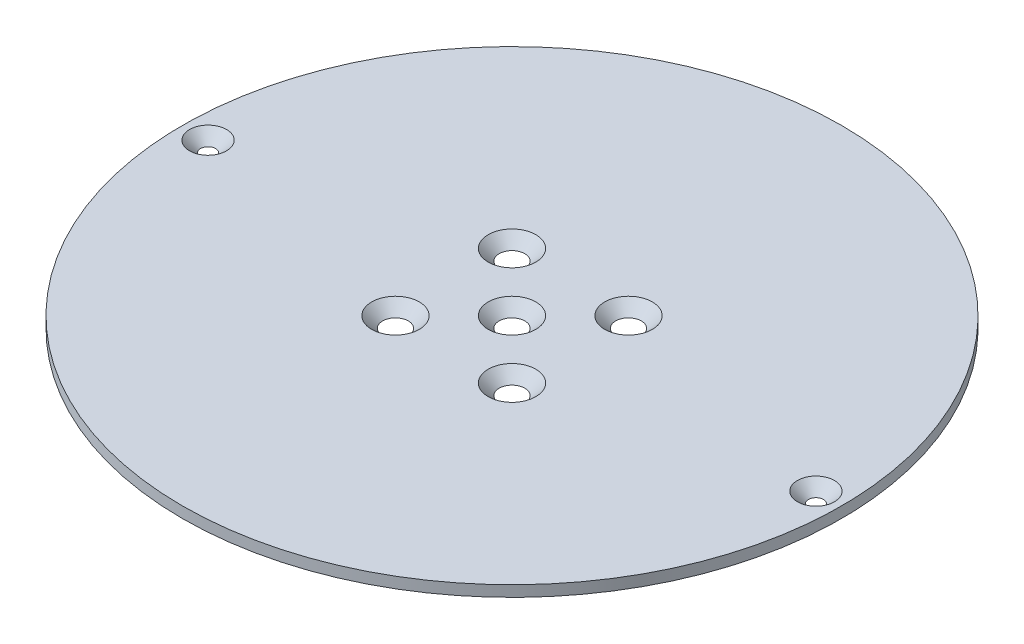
ISO-10303-21;
HEADER;
FILE_DESCRIPTION(('STEP AP214'),'2;1');
FILE_NAME('part.step','',(''),(''),'','','');
FILE_SCHEMA(('AUTOMOTIVE_DESIGN { 1 0 10303 214 1 1 1 1 }'));
ENDSEC;
DATA;
#1=APPLICATION_CONTEXT('core data for automotive mechanical design processes');
#2=APPLICATION_PROTOCOL_DEFINITION('international standard','automotive_design',2000,#1);
#3=PRODUCT_CONTEXT('',#1,'mechanical');
#4=PRODUCT('Part','Part','',(#3));
#5=PRODUCT_RELATED_PRODUCT_CATEGORY('part','',(#4));
#6=PRODUCT_DEFINITION_FORMATION('','',#4);
#7=PRODUCT_DEFINITION_CONTEXT('part definition',#1,'design');
#8=PRODUCT_DEFINITION('design','',#6,#7);
#9=PRODUCT_DEFINITION_SHAPE('','',#8);
#10=(LENGTH_UNIT() NAMED_UNIT(*) SI_UNIT(.MILLI.,.METRE.));
#11=(NAMED_UNIT(*) PLANE_ANGLE_UNIT() SI_UNIT($,.RADIAN.));
#12=(NAMED_UNIT(*) SI_UNIT($,.STERADIAN.) SOLID_ANGLE_UNIT());
#13=UNCERTAINTY_MEASURE_WITH_UNIT(LENGTH_MEASURE(1.E-05),#10,'distance_accuracy_value','');
#14=(GEOMETRIC_REPRESENTATION_CONTEXT(3) GLOBAL_UNCERTAINTY_ASSIGNED_CONTEXT((#13)) GLOBAL_UNIT_ASSIGNED_CONTEXT((#10,
#11,#12)) REPRESENTATION_CONTEXT('',''));
#15=CARTESIAN_POINT('',(0.,0.,0.));
#16=DIRECTION('',(0.,0.,1.));
#17=DIRECTION('',(1.,0.,0.));
#18=AXIS2_PLACEMENT_3D('',#15,#16,#17);
#19=CARTESIAN_POINT('',(0.,3.,0.));
#20=DIRECTION('',(0.,1.,0.));
#21=DIRECTION('',(0.,0.,1.));
#22=AXIS2_PLACEMENT_3D('',#19,#20,#21);
#23=PLANE('',#22);
#24=CARTESIAN_POINT('',(15.9099025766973,3.,15.9099025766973));
#25=DIRECTION('',(0.,1.,0.));
#26=DIRECTION('',(0.,0.,1.));
#27=AXIS2_PLACEMENT_3D('',#24,#25,#26);
#28=CIRCLE('',#27,6.49999999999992);
#29=CARTESIAN_POINT('',(15.9099025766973,3.,22.4099025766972));
#30=VERTEX_POINT('',#29);
#31=EDGE_CURVE('E10',#30,#30,#28,.F.);
#32=ORIENTED_EDGE('',*,*,#31,.T.);
#33=EDGE_LOOP('',(#32));
#34=FACE_BOUND('',#33,.T.);
#35=CARTESIAN_POINT('',(-15.9099025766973,3.,15.9099025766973));
#36=DIRECTION('',(0.,1.,0.));
#37=DIRECTION('',(0.,0.,1.));
#38=AXIS2_PLACEMENT_3D('',#35,#36,#37);
#39=CIRCLE('',#38,6.49999999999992);
#40=CARTESIAN_POINT('',(-15.9099025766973,3.,22.4099025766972));
#41=VERTEX_POINT('',#40);
#42=EDGE_CURVE('E42',#41,#41,#39,.F.);
#43=ORIENTED_EDGE('',*,*,#42,.T.);
#44=EDGE_LOOP('',(#43));
#45=FACE_BOUND('',#44,.T.);
#46=CARTESIAN_POINT('',(0.,3.,0.));
#47=DIRECTION('',(0.,1.,0.));
#48=DIRECTION('',(0.,0.,1.));
#49=AXIS2_PLACEMENT_3D('',#46,#47,#48);
#50=CIRCLE('',#49,6.49999999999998);
#51=CARTESIAN_POINT('',(0.,3.,6.49999999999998));
#52=VERTEX_POINT('',#51);
#53=EDGE_CURVE('E46',#52,#52,#50,.F.);
#54=ORIENTED_EDGE('',*,*,#53,.T.);
#55=EDGE_LOOP('',(#54));
#56=FACE_BOUND('',#55,.T.);
#57=CARTESIAN_POINT('',(15.9099025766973,3.,-15.9099025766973));
#58=DIRECTION('',(0.,1.,0.));
#59=DIRECTION('',(0.,0.,1.));
#60=AXIS2_PLACEMENT_3D('',#57,#58,#59);
#61=CIRCLE('',#60,6.49999999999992);
#62=CARTESIAN_POINT('',(15.9099025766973,3.,-9.4099025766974));
#63=VERTEX_POINT('',#62);
#64=EDGE_CURVE('E50',#63,#63,#61,.F.);
#65=ORIENTED_EDGE('',*,*,#64,.T.);
#66=EDGE_LOOP('',(#65));
#67=FACE_BOUND('',#66,.T.);
#68=CARTESIAN_POINT('',(-15.9099025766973,3.,-15.9099025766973));
#69=DIRECTION('',(0.,1.,0.));
#70=DIRECTION('',(0.,0.,1.));
#71=AXIS2_PLACEMENT_3D('',#68,#69,#70);
#72=CIRCLE('',#71,6.50000000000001);
#73=CARTESIAN_POINT('',(-15.9099025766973,3.,-9.40990257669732));
#74=VERTEX_POINT('',#73);
#75=EDGE_CURVE('E55',#74,#74,#72,.F.);
#76=ORIENTED_EDGE('',*,*,#75,.T.);
#77=EDGE_LOOP('',(#76));
#78=FACE_BOUND('',#77,.T.);
#79=CARTESIAN_POINT('',(83.,3.,0.));
#80=DIRECTION('',(0.,1.,0.));
#81=DIRECTION('',(0.,0.,1.));
#82=AXIS2_PLACEMENT_3D('',#79,#80,#81);
#83=CIRCLE('',#82,5.05000000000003);
#84=CARTESIAN_POINT('',(83.,3.,5.05000000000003));
#85=VERTEX_POINT('',#84);
#86=EDGE_CURVE('E58',#85,#85,#83,.F.);
#87=ORIENTED_EDGE('',*,*,#86,.T.);
#88=EDGE_LOOP('',(#87));
#89=FACE_BOUND('',#88,.T.);
#90=CARTESIAN_POINT('',(-83.,3.,0.));
#91=DIRECTION('',(0.,1.,0.));
#92=DIRECTION('',(0.,0.,1.));
#93=AXIS2_PLACEMENT_3D('',#90,#91,#92);
#94=CIRCLE('',#93,5.05000000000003);
#95=CARTESIAN_POINT('',(-83.,3.,5.05000000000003));
#96=VERTEX_POINT('',#95);
#97=EDGE_CURVE('E61',#96,#96,#94,.F.);
#98=ORIENTED_EDGE('',*,*,#97,.T.);
#99=EDGE_LOOP('',(#98));
#100=FACE_BOUND('',#99,.T.);
#101=CARTESIAN_POINT('',(0.,3.,0.));
#102=DIRECTION('',(0.,1.,0.));
#103=DIRECTION('',(0.,0.,1.));
#104=AXIS2_PLACEMENT_3D('',#101,#102,#103);
#105=CIRCLE('',#104,90.);
#106=CARTESIAN_POINT('',(0.,3.,90.));
#107=VERTEX_POINT('',#106);
#108=EDGE_CURVE('E64',#107,#107,#105,.T.);
#109=ORIENTED_EDGE('',*,*,#108,.T.);
#110=EDGE_LOOP('',(#109));
#111=FACE_BOUND('',#110,.T.);
#112=ADVANCED_FACE('F35',(#34,#45,#56,#67,#78,#89,#100,#111),#23,.T.);
#113=CARTESIAN_POINT('',(0.,0.,0.));
#114=DIRECTION('',(0.,1.,0.));
#115=DIRECTION('',(0.,0.,1.));
#116=AXIS2_PLACEMENT_3D('',#113,#114,#115);
#117=PLANE('',#116);
#118=CARTESIAN_POINT('',(-15.9099025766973,0.,15.9099025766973));
#119=DIRECTION('',(0.,1.,0.));
#120=DIRECTION('',(0.,0.,1.));
#121=AXIS2_PLACEMENT_3D('',#118,#119,#120);
#122=CIRCLE('',#121,3.5);
#123=CARTESIAN_POINT('',(-15.9099025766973,0.,19.4099025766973));
#124=VERTEX_POINT('',#123);
#125=EDGE_CURVE('E85',#124,#124,#122,.T.);
#126=ORIENTED_EDGE('',*,*,#125,.T.);
#127=EDGE_LOOP('',(#126));
#128=FACE_BOUND('',#127,.T.);
#129=CARTESIAN_POINT('',(15.9099025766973,0.,-15.9099025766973));
#130=DIRECTION('',(0.,1.,0.));
#131=DIRECTION('',(0.,0.,1.));
#132=AXIS2_PLACEMENT_3D('',#129,#130,#131);
#133=CIRCLE('',#132,3.5);
#134=CARTESIAN_POINT('',(15.9099025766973,0.,-12.4099025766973));
#135=VERTEX_POINT('',#134);
#136=EDGE_CURVE('E79',#135,#135,#133,.T.);
#137=ORIENTED_EDGE('',*,*,#136,.T.);
#138=EDGE_LOOP('',(#137));
#139=FACE_BOUND('',#138,.T.);
#140=CARTESIAN_POINT('',(-83.,0.,0.));
#141=DIRECTION('',(0.,1.,0.));
#142=DIRECTION('',(0.,0.,-1.));
#143=AXIS2_PLACEMENT_3D('',#140,#141,#142);
#144=CIRCLE('',#143,2.04999999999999);
#145=CARTESIAN_POINT('',(-83.,0.,-2.04999999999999));
#146=VERTEX_POINT('',#145);
#147=EDGE_CURVE('E73',#146,#146,#144,.T.);
#148=ORIENTED_EDGE('',*,*,#147,.T.);
#149=EDGE_LOOP('',(#148));
#150=FACE_BOUND('',#149,.T.);
#151=CARTESIAN_POINT('',(0.,0.,0.));
#152=DIRECTION('',(0.,1.,0.));
#153=DIRECTION('',(0.,0.,1.));
#154=AXIS2_PLACEMENT_3D('',#151,#152,#153);
#155=CIRCLE('',#154,90.);
#156=CARTESIAN_POINT('',(0.,0.,90.));
#157=VERTEX_POINT('',#156);
#158=EDGE_CURVE('E65',#157,#157,#155,.T.);
#159=ORIENTED_EDGE('',*,*,#158,.F.);
#160=EDGE_LOOP('',(#159));
#161=FACE_BOUND('',#160,.T.);
#162=CARTESIAN_POINT('',(83.,0.,0.));
#163=DIRECTION('',(0.,1.,0.));
#164=DIRECTION('',(0.,0.,1.));
#165=AXIS2_PLACEMENT_3D('',#162,#163,#164);
#166=CIRCLE('',#165,2.04999999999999);
#167=CARTESIAN_POINT('',(83.,0.,2.05));
#168=VERTEX_POINT('',#167);
#169=EDGE_CURVE('E68',#168,#168,#166,.T.);
#170=ORIENTED_EDGE('',*,*,#169,.T.);
#171=EDGE_LOOP('',(#170));
#172=FACE_BOUND('',#171,.T.);
#173=CARTESIAN_POINT('',(0.,0.,0.));
#174=DIRECTION('',(0.,1.,0.));
#175=DIRECTION('',(0.,0.,1.));
#176=AXIS2_PLACEMENT_3D('',#173,#174,#175);
#177=CIRCLE('',#176,3.5);
#178=CARTESIAN_POINT('',(0.,0.,3.5));
#179=VERTEX_POINT('',#178);
#180=EDGE_CURVE('E76',#179,#179,#177,.T.);
#181=ORIENTED_EDGE('',*,*,#180,.T.);
#182=EDGE_LOOP('',(#181));
#183=FACE_BOUND('',#182,.T.);
#184=CARTESIAN_POINT('',(15.9099025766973,0.,15.9099025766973));
#185=DIRECTION('',(0.,1.,0.));
#186=DIRECTION('',(0.,0.,1.));
#187=AXIS2_PLACEMENT_3D('',#184,#185,#186);
#188=CIRCLE('',#187,3.5);
#189=CARTESIAN_POINT('',(15.9099025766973,0.,19.4099025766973));
#190=VERTEX_POINT('',#189);
#191=EDGE_CURVE('E82',#190,#190,#188,.T.);
#192=ORIENTED_EDGE('',*,*,#191,.T.);
#193=EDGE_LOOP('',(#192));
#194=FACE_BOUND('',#193,.T.);
#195=CARTESIAN_POINT('',(-15.9099025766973,0.,-15.9099025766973));
#196=DIRECTION('',(0.,1.,0.));
#197=DIRECTION('',(0.,0.,1.));
#198=AXIS2_PLACEMENT_3D('',#195,#196,#197);
#199=CIRCLE('',#198,3.5);
#200=CARTESIAN_POINT('',(-15.9099025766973,0.,-12.4099025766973));
#201=VERTEX_POINT('',#200);
#202=EDGE_CURVE('E88',#201,#201,#199,.T.);
#203=ORIENTED_EDGE('',*,*,#202,.T.);
#204=EDGE_LOOP('',(#203));
#205=FACE_BOUND('',#204,.T.);
#206=ADVANCED_FACE('F92',(#128,#139,#150,#161,#172,#183,#194,#205),#117,.F.);
#207=CARTESIAN_POINT('',(0.,3.,0.));
#208=DIRECTION('',(0.,-1.,0.));
#209=DIRECTION('',(0.,0.,-1.));
#210=AXIS2_PLACEMENT_3D('',#207,#208,#209);
#211=CYLINDRICAL_SURFACE('',#210,90.);
#212=ORIENTED_EDGE('',*,*,#108,.F.);
#213=EDGE_LOOP('',(#212));
#214=FACE_BOUND('',#213,.T.);
#215=ORIENTED_EDGE('',*,*,#158,.T.);
#216=EDGE_LOOP('',(#215));
#217=FACE_BOUND('',#216,.T.);
#218=ADVANCED_FACE('F114',(#214,#217),#211,.T.);
#219=CARTESIAN_POINT('',(15.9099025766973,0.,15.9099025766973));
#220=DIRECTION('',(0.,1.,0.));
#221=DIRECTION('',(0.,0.,1.));
#222=AXIS2_PLACEMENT_3D('',#219,#220,#221);
#223=CONICAL_SURFACE('',#222,3.5,0.785398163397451);
#224=ORIENTED_EDGE('',*,*,#31,.F.);
#225=EDGE_LOOP('',(#224));
#226=FACE_BOUND('',#225,.T.);
#227=ORIENTED_EDGE('',*,*,#191,.F.);
#228=EDGE_LOOP('',(#227));
#229=FACE_BOUND('',#228,.T.);
#230=ADVANCED_FACE('F120',(#226,#229),#223,.F.);
#231=CARTESIAN_POINT('',(-15.9099025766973,0.,15.9099025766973));
#232=DIRECTION('',(0.,1.,0.));
#233=DIRECTION('',(0.,0.,1.));
#234=AXIS2_PLACEMENT_3D('',#231,#232,#233);
#235=CONICAL_SURFACE('',#234,3.5,0.785398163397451);
#236=ORIENTED_EDGE('',*,*,#42,.F.);
#237=EDGE_LOOP('',(#236));
#238=FACE_BOUND('',#237,.T.);
#239=ORIENTED_EDGE('',*,*,#125,.F.);
#240=EDGE_LOOP('',(#239));
#241=FACE_BOUND('',#240,.T.);
#242=ADVANCED_FACE('F124',(#238,#241),#235,.F.);
#243=CARTESIAN_POINT('',(0.,0.,0.));
#244=DIRECTION('',(0.,1.,0.));
#245=DIRECTION('',(0.,0.,1.));
#246=AXIS2_PLACEMENT_3D('',#243,#244,#245);
#247=CONICAL_SURFACE('',#246,3.5,0.785398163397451);
#248=ORIENTED_EDGE('',*,*,#53,.F.);
#249=EDGE_LOOP('',(#248));
#250=FACE_BOUND('',#249,.T.);
#251=ORIENTED_EDGE('',*,*,#180,.F.);
#252=EDGE_LOOP('',(#251));
#253=FACE_BOUND('',#252,.T.);
#254=ADVANCED_FACE('F105',(#250,#253),#247,.F.);
#255=CARTESIAN_POINT('',(15.9099025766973,0.,-15.9099025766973));
#256=DIRECTION('',(0.,1.,0.));
#257=DIRECTION('',(0.,0.,1.));
#258=AXIS2_PLACEMENT_3D('',#255,#256,#257);
#259=CONICAL_SURFACE('',#258,3.5,0.785398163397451);
#260=ORIENTED_EDGE('',*,*,#64,.F.);
#261=EDGE_LOOP('',(#260));
#262=FACE_BOUND('',#261,.T.);
#263=ORIENTED_EDGE('',*,*,#136,.F.);
#264=EDGE_LOOP('',(#263));
#265=FACE_BOUND('',#264,.T.);
#266=ADVANCED_FACE('F97',(#262,#265),#259,.F.);
#267=CARTESIAN_POINT('',(-15.9099025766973,0.,-15.9099025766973));
#268=DIRECTION('',(0.,1.,0.));
#269=DIRECTION('',(0.,0.,1.));
#270=AXIS2_PLACEMENT_3D('',#267,#268,#269);
#271=CONICAL_SURFACE('',#270,3.5,0.785398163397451);
#272=ORIENTED_EDGE('',*,*,#75,.F.);
#273=EDGE_LOOP('',(#272));
#274=FACE_BOUND('',#273,.T.);
#275=ORIENTED_EDGE('',*,*,#202,.F.);
#276=EDGE_LOOP('',(#275));
#277=FACE_BOUND('',#276,.T.);
#278=ADVANCED_FACE('F94',(#274,#277),#271,.F.);
#279=CARTESIAN_POINT('',(83.,0.,0.));
#280=DIRECTION('',(0.,1.,0.));
#281=DIRECTION('',(0.,0.,1.));
#282=AXIS2_PLACEMENT_3D('',#279,#280,#281);
#283=CONICAL_SURFACE('',#282,2.04999999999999,0.785398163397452);
#284=CARTESIAN_POINT('',(83.,3.,5.05000000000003));
#285=CARTESIAN_POINT('',(83.,2.96875,5.01875000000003));
#286=CARTESIAN_POINT('',(83.,2.9375,4.98750000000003));
#287=CARTESIAN_POINT('',(83.,2.875,4.92500000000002));
#288=CARTESIAN_POINT('',(83.,2.84375,4.89375000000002));
#289=CARTESIAN_POINT('',(83.,2.78125,4.83125000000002));
#290=CARTESIAN_POINT('',(83.,2.75,4.80000000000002));
#291=CARTESIAN_POINT('',(83.,2.6875,4.73750000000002));
#292=CARTESIAN_POINT('',(83.,2.65625,4.70625000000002));
#293=CARTESIAN_POINT('',(83.,2.59375,4.64375000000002));
#294=CARTESIAN_POINT('',(83.,2.5625,4.61250000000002));
#295=CARTESIAN_POINT('',(83.,2.5,4.55000000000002));
#296=CARTESIAN_POINT('',(83.,2.46875,4.51875000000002));
#297=CARTESIAN_POINT('',(83.,2.40625,4.45625000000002));
#298=CARTESIAN_POINT('',(83.,2.375,4.42500000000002));
#299=CARTESIAN_POINT('',(83.,2.3125,4.36250000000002));
#300=CARTESIAN_POINT('',(83.,2.28125,4.33125000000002));
#301=CARTESIAN_POINT('',(83.,2.21875,4.26875000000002));
#302=CARTESIAN_POINT('',(83.,2.1875,4.23750000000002));
#303=CARTESIAN_POINT('',(83.,2.125,4.17500000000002));
#304=CARTESIAN_POINT('',(83.,2.09375,4.14375000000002));
#305=CARTESIAN_POINT('',(83.,2.03125,4.08125000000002));
#306=CARTESIAN_POINT('',(83.,2.,4.05000000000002));
#307=CARTESIAN_POINT('',(83.,1.9375,3.98750000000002));
#308=CARTESIAN_POINT('',(83.,1.90625,3.95625000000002));
#309=CARTESIAN_POINT('',(83.,1.84375,3.89375000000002));
#310=CARTESIAN_POINT('',(83.,1.8125,3.86250000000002));
#311=CARTESIAN_POINT('',(83.,1.75,3.80000000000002));
#312=CARTESIAN_POINT('',(83.,1.71875,3.76875000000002));
#313=CARTESIAN_POINT('',(83.,1.65625,3.70625000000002));
#314=CARTESIAN_POINT('',(83.,1.625,3.67500000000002));
#315=CARTESIAN_POINT('',(83.,1.5625,3.61250000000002));
#316=CARTESIAN_POINT('',(83.,1.53125,3.58125000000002));
#317=CARTESIAN_POINT('',(83.,1.46875,3.51875000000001));
#318=CARTESIAN_POINT('',(83.,1.4375,3.48750000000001));
#319=CARTESIAN_POINT('',(83.,1.375,3.42500000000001));
#320=CARTESIAN_POINT('',(83.,1.34375,3.39375000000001));
#321=CARTESIAN_POINT('',(83.,1.28125,3.33125000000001));
#322=CARTESIAN_POINT('',(83.,1.25,3.30000000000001));
#323=CARTESIAN_POINT('',(83.,1.1875,3.23750000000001));
#324=CARTESIAN_POINT('',(83.,1.15625,3.20625000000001));
#325=CARTESIAN_POINT('',(83.,1.09375,3.14375000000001));
#326=CARTESIAN_POINT('',(83.,1.0625,3.11250000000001));
#327=CARTESIAN_POINT('',(83.,1.,3.05000000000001));
#328=CARTESIAN_POINT('',(83.,0.96875,3.01875000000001));
#329=CARTESIAN_POINT('',(83.,0.90625,2.95625000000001));
#330=CARTESIAN_POINT('',(83.,0.875,2.92500000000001));
#331=CARTESIAN_POINT('',(83.,0.8125,2.86250000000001));
#332=CARTESIAN_POINT('',(83.,0.78125,2.83125000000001));
#333=CARTESIAN_POINT('',(83.,0.71875,2.76875000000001));
#334=CARTESIAN_POINT('',(83.,0.6875,2.73750000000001));
#335=CARTESIAN_POINT('',(83.,0.625,2.67500000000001));
#336=CARTESIAN_POINT('',(83.,0.59375,2.64375000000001));
#337=CARTESIAN_POINT('',(83.,0.53125,2.58125000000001));
#338=CARTESIAN_POINT('',(83.,0.5,2.55000000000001));
#339=CARTESIAN_POINT('',(83.,0.4375,2.48750000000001));
#340=CARTESIAN_POINT('',(83.,0.40625,2.45625000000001));
#341=CARTESIAN_POINT('',(83.,0.34375,2.39375000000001));
#342=CARTESIAN_POINT('',(83.,0.3125,2.36250000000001));
#343=CARTESIAN_POINT('',(83.,0.25,2.30000000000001));
#344=CARTESIAN_POINT('',(83.,0.21875,2.26875000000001));
#345=CARTESIAN_POINT('',(83.,0.15625,2.20625000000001));
#346=CARTESIAN_POINT('',(83.,0.125,2.17500000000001));
#347=CARTESIAN_POINT('',(83.,0.0624999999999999,2.11250000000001));
#348=CARTESIAN_POINT('',(83.,0.0312499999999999,2.08125000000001));
#349=CARTESIAN_POINT('',(83.,0.,2.05));
#350=B_SPLINE_CURVE_WITH_KNOTS('',3,(#284,#285,#286,#287,#288,#289,#290,#291,#292,#293,#294,
#295,#296,#297,#298,#299,#300,#301,#302,#303,#304,#305,#306,#307,#308,#309,#310,#311,#312,#313,
#314,#315,#316,#317,#318,#319,#320,#321,#322,#323,#324,#325,#326,#327,#328,#329,#330,#331,#332,
#333,#334,#335,#336,#337,#338,#339,#340,#341,#342,#343,#344,#345,#346,#347,#348,#349),
.UNSPECIFIED.,.F.,.F.,(4,2,2,2,2,2,2,2,2,2,2,2,2,2,2,2,2,2,2,2,2,2,2,2,2,2,2,2,2,2,2,2,4),(0.,
0.132582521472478,0.265165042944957,0.397747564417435,0.530330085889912,0.662912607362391,
0.795495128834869,0.928077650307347,1.06066017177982,1.1932426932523,1.32582521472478,
1.45840773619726,1.59099025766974,1.72357277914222,1.85615530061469,1.98873782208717,
2.12132034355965,2.25390286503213,2.38648538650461,2.51906790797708,2.65165042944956,
2.78423295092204,2.91681547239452,3.049397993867,3.18198051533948,3.31456303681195,
3.44714555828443,3.57972807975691,3.71231060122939,3.84489312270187,3.97747564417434,
4.11005816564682,4.2426406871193),.UNSPECIFIED.);
#351=EDGE_CURVE('BSEAM96',#85,#168,#350,.T.);
#352=ORIENTED_EDGE('',*,*,#86,.F.);
#353=ORIENTED_EDGE('',*,*,#169,.F.);
#354=ORIENTED_EDGE('',*,*,#351,.T.);
#355=ORIENTED_EDGE('',*,*,#351,.F.);
#356=EDGE_LOOP('',(#352,#354,#353,#355));
#357=FACE_BOUND('',#356,.T.);
#358=ADVANCED_FACE('F96',(#357),#283,.F.);
#359=CARTESIAN_POINT('',(-83.,0.,0.));
#360=DIRECTION('',(0.,1.,0.));
#361=DIRECTION('',(0.,0.,1.));
#362=AXIS2_PLACEMENT_3D('',#359,#360,#361);
#363=CONICAL_SURFACE('',#362,2.04999999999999,0.785398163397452);
#364=ORIENTED_EDGE('',*,*,#97,.F.);
#365=EDGE_LOOP('',(#364));
#366=FACE_BOUND('',#365,.T.);
#367=ORIENTED_EDGE('',*,*,#147,.F.);
#368=EDGE_LOOP('',(#367));
#369=FACE_BOUND('',#368,.T.);
#370=ADVANCED_FACE('F37',(#366,#369),#363,.F.);
#371=CLOSED_SHELL('',(#112,#206,#218,#230,#242,#254,#266,#278,#358,#370));
#372=MANIFOLD_SOLID_BREP('B2',#371);
#373=ADVANCED_BREP_SHAPE_REPRESENTATION('',(#18,#372),#14);
#374=SHAPE_DEFINITION_REPRESENTATION(#9,#373);
ENDSEC;
END-ISO-10303-21;
